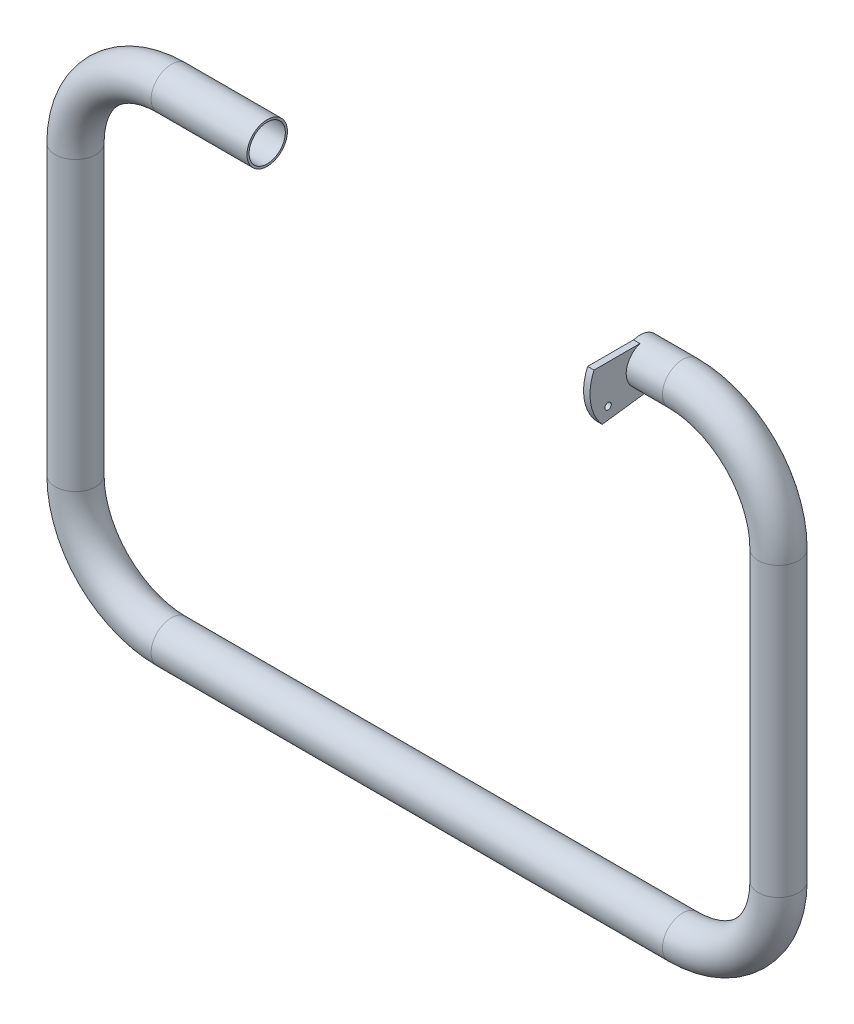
from build123d import *

# Parameters (mm, degrees)
ESQUISSE2_R        = 19
ESQUISSE2_R_2      = 17
ESQUISSE4_R        = 3
BOSS_EXTRU_1_DEPTH = 6


with BuildPart() as part:
    # Base-Balayage-Mince: sweep along a path in Esquisse1
    with BuildLine(Plane.XY) as base_balayage_mince_path:
        Line((0, 0), (40, 0))
        ThreePointArc((40, 0), (103.639610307, -26.360389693), (130, -90))
        Line((130, -90), (130, -360))
        ThreePointArc((130, -360), (103.639610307, -423.639610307), (40, -450))
        Line((40, -450), (-440, -450))
        ThreePointArc((-440, -450), (-503.639610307, -423.639610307), (-530, -360))
        Line((-530, -360), (-530, -90))
        ThreePointArc((-530, -90), (-503.639610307, -26.360389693), (-440, 0))
        Line((-440, 0), (-350, 0))
    # Esquisse2 → Base-Balayage-Mince (sweep)
    with BuildSketch(Plane(origin=(0, 0, 0), x_dir=(0, 0, -1), z_dir=(1, 0, 0))):
        Circle(ESQUISSE2_R)
        Circle(ESQUISSE2_R_2, mode=Mode.SUBTRACT)
    sweep(path=base_balayage_mince_path.line)

    # Esquisse4 → Boss.-Extru.1 (add)
    with BuildSketch(Plane.ZY):
        with BuildLine():
            Line((-18, 0), (-19.5, 0))
            Line((-19.5, 0), (-19.5, -22))
            Line((-19.5, -22), (41.541019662, -30))
            ThreePointArc((41.541019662, -30), (52.431623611, -7.129573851), (49.243181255, 18))
            Line((49.243181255, 18), (0, 18))
            ThreePointArc((0, 18), (12.727922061, -12.727922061), (-18, 0))
        make_face()
        with Locations((36, -18)):
            Circle(ESQUISSE4_R, mode=Mode.SUBTRACT)
    extrude(amount=-BOSS_EXTRU_1_DEPTH)


solid = part.part
